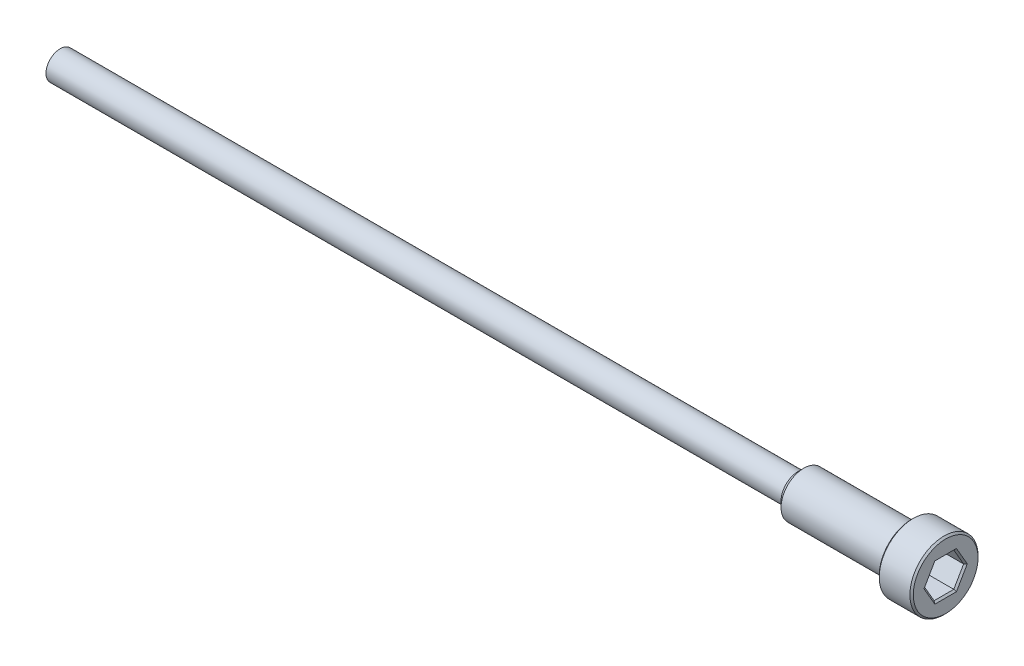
ISO-10303-21;
HEADER;
FILE_DESCRIPTION(('STEP AP214'),'2;1');
FILE_NAME('part.step','',(''),(''),'','','');
FILE_SCHEMA(('AUTOMOTIVE_DESIGN { 1 0 10303 214 1 1 1 1 }'));
ENDSEC;
DATA;
#1=APPLICATION_CONTEXT('core data for automotive mechanical design processes');
#2=APPLICATION_PROTOCOL_DEFINITION('international standard','automotive_design',2000,#1);
#3=PRODUCT_CONTEXT('',#1,'mechanical');
#4=PRODUCT('Part','Part','',(#3));
#5=PRODUCT_RELATED_PRODUCT_CATEGORY('part','',(#4));
#6=PRODUCT_DEFINITION_FORMATION('','',#4);
#7=PRODUCT_DEFINITION_CONTEXT('part definition',#1,'design');
#8=PRODUCT_DEFINITION('design','',#6,#7);
#9=PRODUCT_DEFINITION_SHAPE('','',#8);
#10=(LENGTH_UNIT() NAMED_UNIT(*) SI_UNIT(.MILLI.,.METRE.));
#11=(NAMED_UNIT(*) PLANE_ANGLE_UNIT() SI_UNIT($,.RADIAN.));
#12=(NAMED_UNIT(*) SI_UNIT($,.STERADIAN.) SOLID_ANGLE_UNIT());
#13=UNCERTAINTY_MEASURE_WITH_UNIT(LENGTH_MEASURE(1.E-05),#10,'distance_accuracy_value','');
#14=(GEOMETRIC_REPRESENTATION_CONTEXT(3) GLOBAL_UNCERTAINTY_ASSIGNED_CONTEXT((#13)) GLOBAL_UNIT_ASSIGNED_CONTEXT((#10,
#11,#12)) REPRESENTATION_CONTEXT('',''));
#15=CARTESIAN_POINT('',(0.,0.,0.));
#16=DIRECTION('',(0.,0.,1.));
#17=DIRECTION('',(1.,0.,0.));
#18=AXIS2_PLACEMENT_3D('',#15,#16,#17);
#19=CARTESIAN_POINT('',(156.,0.,0.));
#20=DIRECTION('',(1.,0.,0.));
#21=DIRECTION('',(0.,0.,-1.));
#22=AXIS2_PLACEMENT_3D('',#19,#20,#21);
#23=PLANE('',#22);
#24=DIRECTION('',(0.,0.866025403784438,0.500000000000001));
#25=VECTOR('',#24,1.);
#26=CARTESIAN_POINT('',(156.,-1.64999999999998,2.85788383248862));
#27=LINE('',#26,#25);
#28=CARTESIAN_POINT('',(156.,-3.3,1.90525588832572));
#29=VERTEX_POINT('',#28);
#30=CARTESIAN_POINT('',(156.,0.,3.81051177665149));
#31=VERTEX_POINT('',#30);
#32=EDGE_CURVE('E168',#29,#31,#27,.T.);
#33=ORIENTED_EDGE('',*,*,#32,.T.);
#34=DIRECTION('',(0.,0.866025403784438,-0.500000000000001));
#35=VECTOR('',#34,1.);
#36=CARTESIAN_POINT('',(156.,1.64999999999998,2.85788383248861));
#37=LINE('',#36,#35);
#38=CARTESIAN_POINT('',(156.,3.29999999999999,1.90525588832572));
#39=VERTEX_POINT('',#38);
#40=EDGE_CURVE('E170',#31,#39,#37,.T.);
#41=ORIENTED_EDGE('',*,*,#40,.T.);
#42=DIRECTION('',(0.,0.,-1.));
#43=VECTOR('',#42,1.);
#44=CARTESIAN_POINT('',(156.,3.3,0.));
#45=LINE('',#44,#43);
#46=CARTESIAN_POINT('',(156.,3.3,-1.90525588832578));
#47=VERTEX_POINT('',#46);
#48=EDGE_CURVE('E160',#39,#47,#45,.T.);
#49=ORIENTED_EDGE('',*,*,#48,.T.);
#50=DIRECTION('',(0.,-0.866025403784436,-0.500000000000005));
#51=VECTOR('',#50,1.);
#52=CARTESIAN_POINT('',(156.,1.65000000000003,-2.85788383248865));
#53=LINE('',#52,#51);
#54=CARTESIAN_POINT('',(156.,0.,-3.81051177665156));
#55=VERTEX_POINT('',#54);
#56=EDGE_CURVE('E162',#47,#55,#53,.T.);
#57=ORIENTED_EDGE('',*,*,#56,.T.);
#58=DIRECTION('',(0.,-0.866025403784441,0.499999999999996));
#59=VECTOR('',#58,1.);
#60=CARTESIAN_POINT('',(156.,-1.65,-2.85788383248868));
#61=LINE('',#60,#59);
#62=CARTESIAN_POINT('',(156.,-3.3,-1.9052558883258));
#63=VERTEX_POINT('',#62);
#64=EDGE_CURVE('E164',#55,#63,#61,.T.);
#65=ORIENTED_EDGE('',*,*,#64,.T.);
#66=DIRECTION('',(0.,0.,1.));
#67=VECTOR('',#66,1.);
#68=CARTESIAN_POINT('',(156.,-3.3,0.));
#69=LINE('',#68,#67);
#70=EDGE_CURVE('E166',#63,#29,#69,.T.);
#71=ORIENTED_EDGE('',*,*,#70,.T.);
#72=EDGE_LOOP('',(#33,#41,#49,#57,#65,#71));
#73=FACE_BOUND('',#72,.T.);
#74=CARTESIAN_POINT('',(156.,0.,0.));
#75=DIRECTION('',(1.,0.,0.));
#76=DIRECTION('',(0.,0.,-1.));
#77=AXIS2_PLACEMENT_3D('',#74,#75,#76);
#78=CIRCLE('',#77,5.70000000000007);
#79=CARTESIAN_POINT('',(156.,0.,-5.70000000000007));
#80=VERTEX_POINT('',#79);
#81=EDGE_CURVE('E157',#80,#80,#78,.T.);
#82=ORIENTED_EDGE('',*,*,#81,.T.);
#83=EDGE_LOOP('',(#82));
#84=FACE_BOUND('',#83,.T.);
#85=ADVANCED_FACE('F36',(#73,#84),#23,.T.);
#86=CARTESIAN_POINT('',(130.,0.,0.));
#87=DIRECTION('',(-1.,0.,0.));
#88=DIRECTION('',(0.,0.,1.));
#89=AXIS2_PLACEMENT_3D('',#86,#87,#88);
#90=CYLINDRICAL_SURFACE('',#89,2.5);
#91=CARTESIAN_POINT('',(130.,0.,0.));
#92=DIRECTION('',(1.,0.,0.));
#93=DIRECTION('',(0.,0.,-1.));
#94=AXIS2_PLACEMENT_3D('',#91,#92,#93);
#95=CIRCLE('',#94,2.5);
#96=CARTESIAN_POINT('',(130.,0.,-2.5));
#97=VERTEX_POINT('',#96);
#98=EDGE_CURVE('E146',#97,#97,#95,.T.);
#99=ORIENTED_EDGE('',*,*,#98,.F.);
#100=EDGE_LOOP('',(#99));
#101=FACE_BOUND('',#100,.T.);
#102=CARTESIAN_POINT('',(0.,0.,0.));
#103=DIRECTION('',(1.,0.,0.));
#104=DIRECTION('',(0.,0.,-1.));
#105=AXIS2_PLACEMENT_3D('',#102,#103,#104);
#106=CIRCLE('',#105,2.5);
#107=CARTESIAN_POINT('',(0.,0.,-2.5));
#108=VERTEX_POINT('',#107);
#109=EDGE_CURVE('E140',#108,#108,#106,.T.);
#110=ORIENTED_EDGE('',*,*,#109,.T.);
#111=EDGE_LOOP('',(#110));
#112=FACE_BOUND('',#111,.T.);
#113=ADVANCED_FACE('F255',(#101,#112),#90,.T.);
#114=CARTESIAN_POINT('',(0.,0.,0.));
#115=DIRECTION('',(1.,0.,0.));
#116=DIRECTION('',(0.,0.,-1.));
#117=AXIS2_PLACEMENT_3D('',#114,#115,#116);
#118=PLANE('',#117);
#119=ORIENTED_EDGE('',*,*,#109,.F.);
#120=EDGE_LOOP('',(#119));
#121=FACE_BOUND('',#120,.T.);
#122=ADVANCED_FACE('F261',(#121),#118,.F.);
#123=CARTESIAN_POINT('',(130.,0.,0.));
#124=DIRECTION('',(1.,0.,0.));
#125=DIRECTION('',(0.,0.,-1.));
#126=AXIS2_PLACEMENT_3D('',#123,#124,#125);
#127=PLANE('',#126);
#128=CARTESIAN_POINT('',(130.,0.,0.));
#129=DIRECTION('',(1.,0.,0.));
#130=DIRECTION('',(0.,0.,-1.));
#131=AXIS2_PLACEMENT_3D('',#128,#129,#130);
#132=CIRCLE('',#131,3.00000000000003);
#133=CARTESIAN_POINT('',(130.,0.,-3.00000000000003));
#134=VERTEX_POINT('',#133);
#135=EDGE_CURVE('E154',#134,#134,#132,.F.);
#136=ORIENTED_EDGE('',*,*,#135,.T.);
#137=EDGE_LOOP('',(#136));
#138=FACE_BOUND('',#137,.T.);
#139=ORIENTED_EDGE('',*,*,#98,.T.);
#140=EDGE_LOOP('',(#139));
#141=FACE_BOUND('',#140,.T.);
#142=ADVANCED_FACE('F277',(#138,#141),#127,.F.);
#143=CARTESIAN_POINT('',(150.,0.,0.));
#144=DIRECTION('',(-1.,0.,0.));
#145=DIRECTION('',(0.,0.,1.));
#146=AXIS2_PLACEMENT_3D('',#143,#144,#145);
#147=CYLINDRICAL_SURFACE('',#146,4.);
#148=CARTESIAN_POINT('',(131.,0.,0.));
#149=DIRECTION('',(1.,0.,0.));
#150=DIRECTION('',(0.,0.,-1.));
#151=AXIS2_PLACEMENT_3D('',#148,#149,#150);
#152=CIRCLE('',#151,4.);
#153=CARTESIAN_POINT('',(131.,0.,-4.));
#154=VERTEX_POINT('',#153);
#155=EDGE_CURVE('E149',#154,#154,#152,.T.);
#156=ORIENTED_EDGE('',*,*,#155,.T.);
#157=EDGE_LOOP('',(#156));
#158=FACE_BOUND('',#157,.T.);
#159=CARTESIAN_POINT('',(150.,0.,0.));
#160=DIRECTION('',(1.,0.,0.));
#161=DIRECTION('',(0.,0.,-1.));
#162=AXIS2_PLACEMENT_3D('',#159,#160,#161);
#163=CIRCLE('',#162,4.);
#164=CARTESIAN_POINT('',(150.,0.,-4.));
#165=VERTEX_POINT('',#164);
#166=EDGE_CURVE('E136',#165,#165,#163,.T.);
#167=ORIENTED_EDGE('',*,*,#166,.F.);
#168=EDGE_LOOP('',(#167));
#169=FACE_BOUND('',#168,.T.);
#170=ADVANCED_FACE('F280',(#158,#169),#147,.T.);
#171=CARTESIAN_POINT('',(131.,0.,0.));
#172=DIRECTION('',(1.,0.,0.));
#173=DIRECTION('',(0.,0.,-1.));
#174=AXIS2_PLACEMENT_3D('',#171,#172,#173);
#175=CONICAL_SURFACE('',#174,4.,0.78539816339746);
#176=ORIENTED_EDGE('',*,*,#135,.F.);
#177=EDGE_LOOP('',(#176));
#178=FACE_BOUND('',#177,.T.);
#179=ORIENTED_EDGE('',*,*,#155,.F.);
#180=EDGE_LOOP('',(#179));
#181=FACE_BOUND('',#180,.T.);
#182=ADVANCED_FACE('F272',(#178,#181),#175,.T.);
#183=CARTESIAN_POINT('',(150.,0.,0.));
#184=DIRECTION('',(1.,0.,0.));
#185=DIRECTION('',(0.,0.,-1.));
#186=AXIS2_PLACEMENT_3D('',#183,#184,#185);
#187=PLANE('',#186);
#188=CARTESIAN_POINT('',(150.,0.,0.));
#189=DIRECTION('',(1.,0.,0.));
#190=DIRECTION('',(0.,0.,-1.));
#191=AXIS2_PLACEMENT_3D('',#188,#189,#190);
#192=CIRCLE('',#191,5.69999999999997);
#193=CARTESIAN_POINT('',(150.,0.,-5.69999999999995));
#194=VERTEX_POINT('',#193);
#195=EDGE_CURVE('E11',#194,#194,#192,.F.);
#196=ORIENTED_EDGE('',*,*,#195,.T.);
#197=EDGE_LOOP('',(#196));
#198=FACE_BOUND('',#197,.T.);
#199=ORIENTED_EDGE('',*,*,#166,.T.);
#200=EDGE_LOOP('',(#199));
#201=FACE_BOUND('',#200,.T.);
#202=ADVANCED_FACE('F268',(#198,#201),#187,.F.);
#203=CARTESIAN_POINT('',(156.,0.,0.));
#204=DIRECTION('',(-1.,0.,0.));
#205=DIRECTION('',(0.,0.,1.));
#206=AXIS2_PLACEMENT_3D('',#203,#204,#205);
#207=CYLINDRICAL_SURFACE('',#206,6.);
#208=CARTESIAN_POINT('',(150.3,0.,0.));
#209=DIRECTION('',(1.,0.,0.));
#210=DIRECTION('',(0.,0.,-1.));
#211=AXIS2_PLACEMENT_3D('',#208,#209,#210);
#212=CIRCLE('',#211,6.);
#213=CARTESIAN_POINT('',(150.3,0.,-5.99999999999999));
#214=VERTEX_POINT('',#213);
#215=EDGE_CURVE('E45',#214,#214,#212,.T.);
#216=ORIENTED_EDGE('',*,*,#215,.T.);
#217=EDGE_LOOP('',(#216));
#218=FACE_BOUND('',#217,.T.);
#219=CARTESIAN_POINT('',(155.7,0.,0.));
#220=DIRECTION('',(1.,0.,0.));
#221=DIRECTION('',(0.,0.,-1.));
#222=AXIS2_PLACEMENT_3D('',#219,#220,#221);
#223=CIRCLE('',#222,6.);
#224=CARTESIAN_POINT('',(155.7,0.,-6.));
#225=VERTEX_POINT('',#224);
#226=EDGE_CURVE('E182',#225,#225,#223,.F.);
#227=ORIENTED_EDGE('',*,*,#226,.T.);
#228=EDGE_LOOP('',(#227));
#229=FACE_BOUND('',#228,.T.);
#230=ADVANCED_FACE('F271',(#218,#229),#207,.T.);
#231=CARTESIAN_POINT('',(150.,-3.00000000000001,1.73205080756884));
#232=DIRECTION('',(0.,0.500000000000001,-0.866025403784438));
#233=DIRECTION('',(0.,0.866025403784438,0.500000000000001));
#234=AXIS2_PLACEMENT_3D('',#231,#232,#233);
#235=PLANE('',#234);
#236=DIRECTION('',(1.,0.,0.));
#237=VECTOR('',#236,1.);
#238=CARTESIAN_POINT('',(150.,0.,3.46410161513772));
#239=LINE('',#238,#237);
#240=CARTESIAN_POINT('',(150.,0.,3.46410161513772));
#241=VERTEX_POINT('',#240);
#242=CARTESIAN_POINT('',(155.7,0.,3.46410161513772));
#243=VERTEX_POINT('',#242);
#244=EDGE_CURVE('E128',#241,#243,#239,.T.);
#245=ORIENTED_EDGE('',*,*,#244,.T.);
#246=DIRECTION('',(0.,-0.866025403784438,-0.500000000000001));
#247=VECTOR('',#246,1.);
#248=CARTESIAN_POINT('',(155.7,-3.00000000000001,1.73205080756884));
#249=LINE('',#248,#247);
#250=CARTESIAN_POINT('',(155.7,-3.00000000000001,1.73205080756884));
#251=VERTEX_POINT('',#250);
#252=EDGE_CURVE('E174',#243,#251,#249,.T.);
#253=ORIENTED_EDGE('',*,*,#252,.T.);
#254=DIRECTION('',(1.,0.,0.));
#255=VECTOR('',#254,1.);
#256=CARTESIAN_POINT('',(150.,-3.00000000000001,1.73205080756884));
#257=LINE('',#256,#255);
#258=CARTESIAN_POINT('',(150.,-3.00000000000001,1.73205080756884));
#259=VERTEX_POINT('',#258);
#260=EDGE_CURVE('E130',#259,#251,#257,.T.);
#261=ORIENTED_EDGE('',*,*,#260,.F.);
#262=DIRECTION('',(0.,0.866025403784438,0.500000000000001));
#263=VECTOR('',#262,1.);
#264=CARTESIAN_POINT('',(150.,-3.00000000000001,1.73205080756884));
#265=LINE('',#264,#263);
#266=EDGE_CURVE('E116',#259,#241,#265,.T.);
#267=ORIENTED_EDGE('',*,*,#266,.T.);
#268=EDGE_LOOP('',(#245,#253,#261,#267));
#269=FACE_BOUND('',#268,.T.);
#270=ADVANCED_FACE('F127',(#269),#235,.T.);
#271=CARTESIAN_POINT('',(150.,0.,3.46410161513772));
#272=DIRECTION('',(0.,-0.500000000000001,-0.866025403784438));
#273=DIRECTION('',(0.,0.866025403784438,-0.500000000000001));
#274=AXIS2_PLACEMENT_3D('',#271,#272,#273);
#275=PLANE('',#274);
#276=DIRECTION('',(1.,0.,0.));
#277=VECTOR('',#276,1.);
#278=CARTESIAN_POINT('',(150.,3.,1.73205080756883));
#279=LINE('',#278,#277);
#280=CARTESIAN_POINT('',(150.,3.,1.73205080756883));
#281=VERTEX_POINT('',#280);
#282=CARTESIAN_POINT('',(155.7,3.,1.73205080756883));
#283=VERTEX_POINT('',#282);
#284=EDGE_CURVE('E137',#281,#283,#279,.T.);
#285=ORIENTED_EDGE('',*,*,#284,.T.);
#286=DIRECTION('',(0.,-0.866025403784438,0.500000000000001));
#287=VECTOR('',#286,1.);
#288=CARTESIAN_POINT('',(155.7,0.,3.46410161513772));
#289=LINE('',#288,#287);
#290=EDGE_CURVE('E135',#283,#243,#289,.T.);
#291=ORIENTED_EDGE('',*,*,#290,.T.);
#292=ORIENTED_EDGE('',*,*,#244,.F.);
#293=DIRECTION('',(0.,0.866025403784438,-0.500000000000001));
#294=VECTOR('',#293,1.);
#295=CARTESIAN_POINT('',(150.,0.,3.46410161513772));
#296=LINE('',#295,#294);
#297=EDGE_CURVE('E112',#241,#281,#296,.T.);
#298=ORIENTED_EDGE('',*,*,#297,.T.);
#299=EDGE_LOOP('',(#285,#291,#292,#298));
#300=FACE_BOUND('',#299,.T.);
#301=ADVANCED_FACE('F133',(#300),#275,.T.);
#302=CARTESIAN_POINT('',(150.,3.,1.73205080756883));
#303=DIRECTION('',(0.,-1.,0.));
#304=DIRECTION('',(0.,0.,-1.));
#305=AXIS2_PLACEMENT_3D('',#302,#303,#304);
#306=PLANE('',#305);
#307=DIRECTION('',(1.,0.,0.));
#308=VECTOR('',#307,1.);
#309=CARTESIAN_POINT('',(150.,3.,-1.73205080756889));
#310=LINE('',#309,#308);
#311=CARTESIAN_POINT('',(150.,3.,-1.73205080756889));
#312=VERTEX_POINT('',#311);
#313=CARTESIAN_POINT('',(155.7,3.,-1.73205080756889));
#314=VERTEX_POINT('',#313);
#315=EDGE_CURVE('E142',#312,#314,#310,.T.);
#316=ORIENTED_EDGE('',*,*,#315,.T.);
#317=DIRECTION('',(0.,0.,1.));
#318=VECTOR('',#317,1.);
#319=CARTESIAN_POINT('',(155.7,3.,1.73205080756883));
#320=LINE('',#319,#318);
#321=EDGE_CURVE('E180',#314,#283,#320,.T.);
#322=ORIENTED_EDGE('',*,*,#321,.T.);
#323=ORIENTED_EDGE('',*,*,#284,.F.);
#324=DIRECTION('',(0.,0.,-1.));
#325=VECTOR('',#324,1.);
#326=CARTESIAN_POINT('',(150.,3.,1.73205080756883));
#327=LINE('',#326,#325);
#328=EDGE_CURVE('E118',#281,#312,#327,.T.);
#329=ORIENTED_EDGE('',*,*,#328,.T.);
#330=EDGE_LOOP('',(#316,#322,#323,#329));
#331=FACE_BOUND('',#330,.T.);
#332=ADVANCED_FACE('F219',(#331),#306,.T.);
#333=CARTESIAN_POINT('',(150.,3.,-1.73205080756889));
#334=DIRECTION('',(0.,-0.500000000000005,0.866025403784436));
#335=DIRECTION('',(0.,-0.866025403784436,-0.500000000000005));
#336=AXIS2_PLACEMENT_3D('',#333,#334,#335);
#337=PLANE('',#336);
#338=DIRECTION('',(1.,0.,0.));
#339=VECTOR('',#338,1.);
#340=CARTESIAN_POINT('',(150.,0.,-3.46410161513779));
#341=LINE('',#340,#339);
#342=CARTESIAN_POINT('',(150.,0.,-3.46410161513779));
#343=VERTEX_POINT('',#342);
#344=CARTESIAN_POINT('',(155.7,0.,-3.46410161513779));
#345=VERTEX_POINT('',#344);
#346=EDGE_CURVE('E234',#343,#345,#341,.T.);
#347=ORIENTED_EDGE('',*,*,#346,.T.);
#348=DIRECTION('',(0.,0.866025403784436,0.500000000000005));
#349=VECTOR('',#348,1.);
#350=CARTESIAN_POINT('',(155.7,3.,-1.73205080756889));
#351=LINE('',#350,#349);
#352=EDGE_CURVE('E53',#345,#314,#351,.T.);
#353=ORIENTED_EDGE('',*,*,#352,.T.);
#354=ORIENTED_EDGE('',*,*,#315,.F.);
#355=DIRECTION('',(0.,-0.866025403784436,-0.500000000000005));
#356=VECTOR('',#355,1.);
#357=CARTESIAN_POINT('',(150.,3.,-1.73205080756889));
#358=LINE('',#357,#356);
#359=EDGE_CURVE('E241',#312,#343,#358,.T.);
#360=ORIENTED_EDGE('',*,*,#359,.T.);
#361=EDGE_LOOP('',(#347,#353,#354,#360));
#362=FACE_BOUND('',#361,.T.);
#363=ADVANCED_FACE('F240',(#362),#337,.T.);
#364=CARTESIAN_POINT('',(150.,0.,-3.46410161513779));
#365=DIRECTION('',(0.,0.499999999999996,0.866025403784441));
#366=DIRECTION('',(0.,-0.866025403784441,0.499999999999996));
#367=AXIS2_PLACEMENT_3D('',#364,#365,#366);
#368=PLANE('',#367);
#369=DIRECTION('',(1.,0.,0.));
#370=VECTOR('',#369,1.);
#371=CARTESIAN_POINT('',(150.,-3.00000000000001,-1.73205080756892));
#372=LINE('',#371,#370);
#373=CARTESIAN_POINT('',(150.,-3.00000000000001,-1.73205080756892));
#374=VERTEX_POINT('',#373);
#375=CARTESIAN_POINT('',(155.7,-3.00000000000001,-1.73205080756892));
#376=VERTEX_POINT('',#375);
#377=EDGE_CURVE('E232',#374,#376,#372,.T.);
#378=ORIENTED_EDGE('',*,*,#377,.T.);
#379=DIRECTION('',(0.,0.866025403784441,-0.499999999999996));
#380=VECTOR('',#379,1.);
#381=CARTESIAN_POINT('',(155.7,0.,-3.46410161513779));
#382=LINE('',#381,#380);
#383=EDGE_CURVE('E61',#376,#345,#382,.T.);
#384=ORIENTED_EDGE('',*,*,#383,.T.);
#385=ORIENTED_EDGE('',*,*,#346,.F.);
#386=DIRECTION('',(0.,-0.866025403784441,0.499999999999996));
#387=VECTOR('',#386,1.);
#388=CARTESIAN_POINT('',(150.,0.,-3.46410161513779));
#389=LINE('',#388,#387);
#390=EDGE_CURVE('E236',#343,#374,#389,.T.);
#391=ORIENTED_EDGE('',*,*,#390,.T.);
#392=EDGE_LOOP('',(#378,#384,#385,#391));
#393=FACE_BOUND('',#392,.T.);
#394=ADVANCED_FACE('F243',(#393),#368,.T.);
#395=CARTESIAN_POINT('',(150.,-3.00000000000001,-1.73205080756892));
#396=DIRECTION('',(0.,1.,0.));
#397=DIRECTION('',(0.,0.,1.));
#398=AXIS2_PLACEMENT_3D('',#395,#396,#397);
#399=PLANE('',#398);
#400=ORIENTED_EDGE('',*,*,#260,.T.);
#401=DIRECTION('',(0.,0.,-1.));
#402=VECTOR('',#401,1.);
#403=CARTESIAN_POINT('',(155.7,-3.00000000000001,-1.73205080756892));
#404=LINE('',#403,#402);
#405=EDGE_CURVE('E176',#251,#376,#404,.T.);
#406=ORIENTED_EDGE('',*,*,#405,.T.);
#407=ORIENTED_EDGE('',*,*,#377,.F.);
#408=DIRECTION('',(0.,0.,1.));
#409=VECTOR('',#408,1.);
#410=CARTESIAN_POINT('',(150.,-3.00000000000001,-1.73205080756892));
#411=LINE('',#410,#409);
#412=EDGE_CURVE('E231',#374,#259,#411,.T.);
#413=ORIENTED_EDGE('',*,*,#412,.T.);
#414=EDGE_LOOP('',(#400,#406,#407,#413));
#415=FACE_BOUND('',#414,.T.);
#416=ADVANCED_FACE('F229',(#415),#399,.T.);
#417=CARTESIAN_POINT('',(150.,0.,3.46410161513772));
#418=DIRECTION('',(-1.,0.,0.));
#419=DIRECTION('',(0.,0.,1.));
#420=AXIS2_PLACEMENT_3D('',#417,#418,#419);
#421=PLANE('',#420);
#422=ORIENTED_EDGE('',*,*,#266,.F.);
#423=ORIENTED_EDGE('',*,*,#412,.F.);
#424=ORIENTED_EDGE('',*,*,#390,.F.);
#425=ORIENTED_EDGE('',*,*,#359,.F.);
#426=ORIENTED_EDGE('',*,*,#328,.F.);
#427=ORIENTED_EDGE('',*,*,#297,.F.);
#428=EDGE_LOOP('',(#422,#423,#424,#425,#426,#427));
#429=FACE_BOUND('',#428,.T.);
#430=ADVANCED_FACE('F114',(#429),#421,.F.);
#431=CARTESIAN_POINT('',(156.,-1.65,-2.85788383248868));
#432=DIRECTION('',(-0.707106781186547,-0.353553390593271,-0.612372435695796));
#433=DIRECTION('',(-0.654653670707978,0.,0.755928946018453));
#434=AXIS2_PLACEMENT_3D('',#431,#432,#433);
#435=PLANE('',#434);
#436=DIRECTION('',(0.654653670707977,0.,-0.755928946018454));
#437=VECTOR('',#436,1.);
#438=CARTESIAN_POINT('',(155.528571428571,0.,-3.26615295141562));
#439=LINE('',#438,#437);
#440=EDGE_CURVE('E196',#345,#55,#439,.T.);
#441=ORIENTED_EDGE('',*,*,#440,.F.);
#442=ORIENTED_EDGE('',*,*,#383,.F.);
#443=DIRECTION('',(0.654653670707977,-0.654653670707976,-0.377964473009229));
#444=VECTOR('',#443,1.);
#445=CARTESIAN_POINT('',(155.528571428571,-2.82857142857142,-1.63307647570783));
#446=LINE('',#445,#444);
#447=EDGE_CURVE('E40',#63,#376,#446,.F.);
#448=ORIENTED_EDGE('',*,*,#447,.F.);
#449=ORIENTED_EDGE('',*,*,#64,.F.);
#450=EDGE_LOOP('',(#441,#442,#448,#449));
#451=FACE_BOUND('',#450,.T.);
#452=ADVANCED_FACE('F210',(#451),#435,.F.);
#453=CARTESIAN_POINT('',(156.,-3.3,0.));
#454=DIRECTION('',(-0.707106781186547,-0.707106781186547,0.));
#455=DIRECTION('',(0.707106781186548,-0.707106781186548,0.));
#456=AXIS2_PLACEMENT_3D('',#453,#454,#455);
#457=PLANE('',#456);
#458=ORIENTED_EDGE('',*,*,#447,.T.);
#459=ORIENTED_EDGE('',*,*,#405,.F.);
#460=DIRECTION('',(0.654653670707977,-0.654653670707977,0.377964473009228));
#461=VECTOR('',#460,1.);
#462=CARTESIAN_POINT('',(155.528571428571,-2.82857142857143,1.63307647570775));
#463=LINE('',#462,#461);
#464=EDGE_CURVE('E194',#29,#251,#463,.F.);
#465=ORIENTED_EDGE('',*,*,#464,.F.);
#466=ORIENTED_EDGE('',*,*,#70,.F.);
#467=EDGE_LOOP('',(#458,#459,#465,#466));
#468=FACE_BOUND('',#467,.T.);
#469=ADVANCED_FACE('F206',(#468),#457,.F.);
#470=CARTESIAN_POINT('',(156.,1.65000000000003,-2.85788383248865));
#471=DIRECTION('',(-0.707106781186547,0.353553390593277,-0.612372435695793));
#472=DIRECTION('',(-0.654653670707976,0.,0.755928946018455));
#473=AXIS2_PLACEMENT_3D('',#470,#471,#472);
#474=PLANE('',#473);
#475=ORIENTED_EDGE('',*,*,#440,.T.);
#476=ORIENTED_EDGE('',*,*,#56,.F.);
#477=DIRECTION('',(0.654653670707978,0.654653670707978,-0.377964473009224));
#478=VECTOR('',#477,1.);
#479=CARTESIAN_POINT('',(155.528571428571,2.82857142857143,-1.63307647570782));
#480=LINE('',#479,#478);
#481=EDGE_CURVE('E191',#314,#47,#480,.T.);
#482=ORIENTED_EDGE('',*,*,#481,.F.);
#483=ORIENTED_EDGE('',*,*,#352,.F.);
#484=EDGE_LOOP('',(#475,#476,#482,#483));
#485=FACE_BOUND('',#484,.T.);
#486=ADVANCED_FACE('F212',(#485),#474,.F.);
#487=CARTESIAN_POINT('',(156.,-1.64999999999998,2.85788383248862));
#488=DIRECTION('',(-0.707106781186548,-0.353553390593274,0.612372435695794));
#489=DIRECTION('',(0.654653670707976,0.,0.755928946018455));
#490=AXIS2_PLACEMENT_3D('',#487,#488,#489);
#491=PLANE('',#490);
#492=ORIENTED_EDGE('',*,*,#464,.T.);
#493=ORIENTED_EDGE('',*,*,#252,.F.);
#494=DIRECTION('',(0.654653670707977,0.,0.755928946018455));
#495=VECTOR('',#494,1.);
#496=CARTESIAN_POINT('',(155.528571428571,0.,3.26615295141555));
#497=LINE('',#496,#495);
#498=EDGE_CURVE('E189',#31,#243,#497,.F.);
#499=ORIENTED_EDGE('',*,*,#498,.F.);
#500=ORIENTED_EDGE('',*,*,#32,.F.);
#501=EDGE_LOOP('',(#492,#493,#499,#500));
#502=FACE_BOUND('',#501,.T.);
#503=ADVANCED_FACE('F227',(#502),#491,.F.);
#504=CARTESIAN_POINT('',(156.,3.3,0.));
#505=DIRECTION('',(-0.707106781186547,0.707106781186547,0.));
#506=DIRECTION('',(-0.707106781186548,-0.707106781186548,0.));
#507=AXIS2_PLACEMENT_3D('',#504,#505,#506);
#508=PLANE('',#507);
#509=ORIENTED_EDGE('',*,*,#481,.T.);
#510=ORIENTED_EDGE('',*,*,#48,.F.);
#511=DIRECTION('',(-0.654653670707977,-0.654653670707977,-0.377964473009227));
#512=VECTOR('',#511,1.);
#513=CARTESIAN_POINT('',(155.528571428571,2.82857142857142,1.63307647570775));
#514=LINE('',#513,#512);
#515=EDGE_CURVE('E187',#283,#39,#514,.F.);
#516=ORIENTED_EDGE('',*,*,#515,.F.);
#517=ORIENTED_EDGE('',*,*,#321,.F.);
#518=EDGE_LOOP('',(#509,#510,#516,#517));
#519=FACE_BOUND('',#518,.T.);
#520=ADVANCED_FACE('F217',(#519),#508,.F.);
#521=CARTESIAN_POINT('',(156.,1.64999999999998,2.85788383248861));
#522=DIRECTION('',(-0.707106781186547,0.353553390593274,0.612372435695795));
#523=DIRECTION('',(0.654653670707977,0.,0.755928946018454));
#524=AXIS2_PLACEMENT_3D('',#521,#522,#523);
#525=PLANE('',#524);
#526=ORIENTED_EDGE('',*,*,#498,.T.);
#527=ORIENTED_EDGE('',*,*,#290,.F.);
#528=ORIENTED_EDGE('',*,*,#515,.T.);
#529=ORIENTED_EDGE('',*,*,#40,.F.);
#530=EDGE_LOOP('',(#526,#527,#528,#529));
#531=FACE_BOUND('',#530,.T.);
#532=ADVANCED_FACE('F221',(#531),#525,.F.);
#533=CARTESIAN_POINT('',(150.3,0.,0.));
#534=DIRECTION('',(1.,0.,0.));
#535=DIRECTION('',(0.,0.,-1.));
#536=AXIS2_PLACEMENT_3D('',#533,#534,#535);
#537=CONICAL_SURFACE('',#536,6.,0.785398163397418);
#538=CARTESIAN_POINT('',(150.,0.,-5.69999999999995));
#539=CARTESIAN_POINT('',(150.003125,0.,-5.70312499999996));
#540=CARTESIAN_POINT('',(150.00625,0.,-5.70624999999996));
#541=CARTESIAN_POINT('',(150.0125,0.,-5.71249999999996));
#542=CARTESIAN_POINT('',(150.015625,0.,-5.71562499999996));
#543=CARTESIAN_POINT('',(150.021875,0.,-5.72187499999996));
#544=CARTESIAN_POINT('',(150.025,0.,-5.72499999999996));
#545=CARTESIAN_POINT('',(150.03125,0.,-5.73124999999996));
#546=CARTESIAN_POINT('',(150.034375,0.,-5.73437499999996));
#547=CARTESIAN_POINT('',(150.040625,0.,-5.74062499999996));
#548=CARTESIAN_POINT('',(150.04375,0.,-5.74374999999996));
#549=CARTESIAN_POINT('',(150.05,0.,-5.74999999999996));
#550=CARTESIAN_POINT('',(150.053125,0.,-5.75312499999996));
#551=CARTESIAN_POINT('',(150.059375,0.,-5.75937499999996));
#552=CARTESIAN_POINT('',(150.0625,0.,-5.76249999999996));
#553=CARTESIAN_POINT('',(150.06875,0.,-5.76874999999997));
#554=CARTESIAN_POINT('',(150.071875,0.,-5.77187499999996));
#555=CARTESIAN_POINT('',(150.078125,0.,-5.77812499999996));
#556=CARTESIAN_POINT('',(150.08125,0.,-5.78124999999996));
#557=CARTESIAN_POINT('',(150.0875,0.,-5.78749999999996));
#558=CARTESIAN_POINT('',(150.090625,0.,-5.79062499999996));
#559=CARTESIAN_POINT('',(150.096875,0.,-5.79687499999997));
#560=CARTESIAN_POINT('',(150.1,0.,-5.79999999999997));
#561=CARTESIAN_POINT('',(150.10625,0.,-5.80624999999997));
#562=CARTESIAN_POINT('',(150.109375,0.,-5.80937499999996));
#563=CARTESIAN_POINT('',(150.115625,0.,-5.81562499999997));
#564=CARTESIAN_POINT('',(150.11875,0.,-5.81874999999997));
#565=CARTESIAN_POINT('',(150.125,0.,-5.82499999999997));
#566=CARTESIAN_POINT('',(150.128125,0.,-5.82812499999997));
#567=CARTESIAN_POINT('',(150.134375,0.,-5.83437499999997));
#568=CARTESIAN_POINT('',(150.1375,0.,-5.83749999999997));
#569=CARTESIAN_POINT('',(150.14375,0.,-5.84374999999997));
#570=CARTESIAN_POINT('',(150.146875,0.,-5.84687499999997));
#571=CARTESIAN_POINT('',(150.153125,0.,-5.85312499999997));
#572=CARTESIAN_POINT('',(150.15625,0.,-5.85624999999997));
#573=CARTESIAN_POINT('',(150.1625,0.,-5.86249999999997));
#574=CARTESIAN_POINT('',(150.165625,0.,-5.86562499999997));
#575=CARTESIAN_POINT('',(150.171875,0.,-5.87187499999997));
#576=CARTESIAN_POINT('',(150.175,0.,-5.87499999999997));
#577=CARTESIAN_POINT('',(150.18125,0.,-5.88124999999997));
#578=CARTESIAN_POINT('',(150.184375,0.,-5.88437499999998));
#579=CARTESIAN_POINT('',(150.190625,0.,-5.89062499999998));
#580=CARTESIAN_POINT('',(150.19375,0.,-5.89374999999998));
#581=CARTESIAN_POINT('',(150.2,0.,-5.89999999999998));
#582=CARTESIAN_POINT('',(150.203125,0.,-5.90312499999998));
#583=CARTESIAN_POINT('',(150.209375,0.,-5.90937499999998));
#584=CARTESIAN_POINT('',(150.2125,0.,-5.91249999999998));
#585=CARTESIAN_POINT('',(150.21875,0.,-5.91874999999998));
#586=CARTESIAN_POINT('',(150.221875,0.,-5.92187499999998));
#587=CARTESIAN_POINT('',(150.228125,0.,-5.92812499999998));
#588=CARTESIAN_POINT('',(150.23125,0.,-5.93124999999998));
#589=CARTESIAN_POINT('',(150.2375,0.,-5.93749999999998));
#590=CARTESIAN_POINT('',(150.240625,0.,-5.94062499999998));
#591=CARTESIAN_POINT('',(150.246875,0.,-5.94687499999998));
#592=CARTESIAN_POINT('',(150.25,0.,-5.94999999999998));
#593=CARTESIAN_POINT('',(150.25625,0.,-5.95624999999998));
#594=CARTESIAN_POINT('',(150.259375,0.,-5.95937499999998));
#595=CARTESIAN_POINT('',(150.265625,0.,-5.96562499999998));
#596=CARTESIAN_POINT('',(150.26875,0.,-5.96874999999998));
#597=CARTESIAN_POINT('',(150.275,0.,-5.97499999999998));
#598=CARTESIAN_POINT('',(150.278125,0.,-5.97812499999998));
#599=CARTESIAN_POINT('',(150.284375,0.,-5.98437499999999));
#600=CARTESIAN_POINT('',(150.2875,0.,-5.98749999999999));
#601=CARTESIAN_POINT('',(150.29375,0.,-5.99374999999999));
#602=CARTESIAN_POINT('',(150.296875,0.,-5.99687499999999));
#603=CARTESIAN_POINT('',(150.3,0.,-5.99999999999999));
#604=B_SPLINE_CURVE_WITH_KNOTS('',3,(#538,#539,#540,#541,#542,#543,#544,#545,#546,#547,#548,
#549,#550,#551,#552,#553,#554,#555,#556,#557,#558,#559,#560,#561,#562,#563,#564,#565,#566,#567,
#568,#569,#570,#571,#572,#573,#574,#575,#576,#577,#578,#579,#580,#581,#582,#583,#584,#585,#586,
#587,#588,#589,#590,#591,#592,#593,#594,#595,#596,#597,#598,#599,#600,#601,#602,#603),
.UNSPECIFIED.,.F.,.F.,(4,2,2,2,2,2,2,2,2,2,2,2,2,2,2,2,2,2,2,2,2,2,2,2,2,2,2,2,2,2,2,2,4),(0.,
0.0132582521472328,0.0265165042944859,0.0397747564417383,0.0530330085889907,0.0662912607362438,
0.0795495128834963,0.0928077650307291,0.106066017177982,0.119324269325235,0.132582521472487,
0.14584077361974,0.159099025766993,0.172357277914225,0.185615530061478,0.198873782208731,
0.212132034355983,0.225390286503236,0.238648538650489,0.251906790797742,0.265165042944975,
0.278423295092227,0.29168154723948,0.304939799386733,0.318198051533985,0.331456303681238,
0.344714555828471,0.357972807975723,0.371231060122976,0.384489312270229,0.397747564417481,
0.411005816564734,0.424264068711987),.UNSPECIFIED.);
#605=EDGE_CURVE('BSEAM293',#194,#214,#604,.T.);
#606=ORIENTED_EDGE('',*,*,#195,.F.);
#607=ORIENTED_EDGE('',*,*,#215,.F.);
#608=ORIENTED_EDGE('',*,*,#605,.T.);
#609=ORIENTED_EDGE('',*,*,#605,.F.);
#610=EDGE_LOOP('',(#606,#608,#607,#609));
#611=FACE_BOUND('',#610,.T.);
#612=ADVANCED_FACE('F293',(#611),#537,.T.);
#613=CARTESIAN_POINT('',(156.,0.,0.));
#614=DIRECTION('',(-1.,0.,0.));
#615=DIRECTION('',(0.,0.,1.));
#616=AXIS2_PLACEMENT_3D('',#613,#614,#615);
#617=CONICAL_SURFACE('',#616,5.70000000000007,0.785398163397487);
#618=ORIENTED_EDGE('',*,*,#226,.F.);
#619=EDGE_LOOP('',(#618));
#620=FACE_BOUND('',#619,.T.);
#621=ORIENTED_EDGE('',*,*,#81,.F.);
#622=EDGE_LOOP('',(#621));
#623=FACE_BOUND('',#622,.T.);
#624=ADVANCED_FACE('F38',(#620,#623),#617,.T.);
#625=CLOSED_SHELL('',(#85,#113,#122,#142,#170,#182,#202,#230,#270,#301,#332,#363,#394,#416,#430,
#452,#469,#486,#503,#520,#532,#612,#624));
#626=MANIFOLD_SOLID_BREP('B2',#625);
#627=ADVANCED_BREP_SHAPE_REPRESENTATION('',(#18,#626),#14);
#628=SHAPE_DEFINITION_REPRESENTATION(#9,#627);
ENDSEC;
END-ISO-10303-21;
